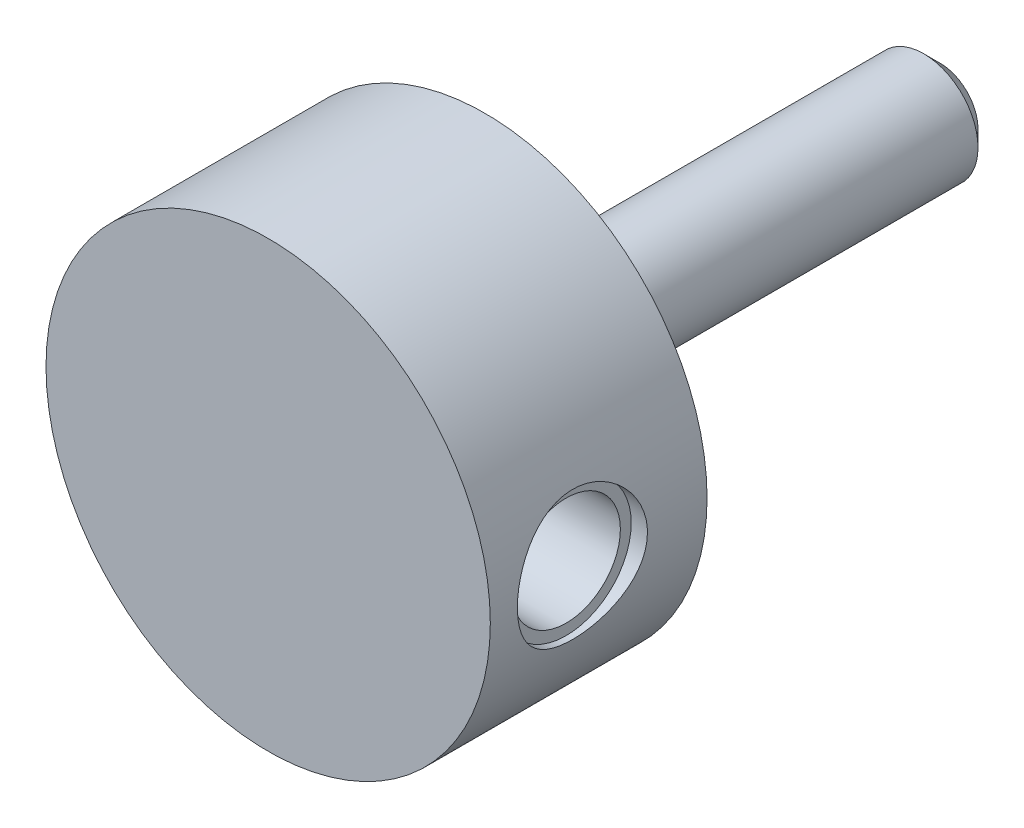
ISO-10303-21;
HEADER;
FILE_DESCRIPTION(('STEP AP214'),'2;1');
FILE_NAME('part.step','',(''),(''),'','','');
FILE_SCHEMA(('AUTOMOTIVE_DESIGN { 1 0 10303 214 1 1 1 1 }'));
ENDSEC;
DATA;
#1=APPLICATION_CONTEXT('core data for automotive mechanical design processes');
#2=APPLICATION_PROTOCOL_DEFINITION('international standard','automotive_design',2000,#1);
#3=PRODUCT_CONTEXT('',#1,'mechanical');
#4=PRODUCT('Part','Part','',(#3));
#5=PRODUCT_RELATED_PRODUCT_CATEGORY('part','',(#4));
#6=PRODUCT_DEFINITION_FORMATION('','',#4);
#7=PRODUCT_DEFINITION_CONTEXT('part definition',#1,'design');
#8=PRODUCT_DEFINITION('design','',#6,#7);
#9=PRODUCT_DEFINITION_SHAPE('','',#8);
#10=(LENGTH_UNIT() NAMED_UNIT(*) SI_UNIT(.MILLI.,.METRE.));
#11=(NAMED_UNIT(*) PLANE_ANGLE_UNIT() SI_UNIT($,.RADIAN.));
#12=(NAMED_UNIT(*) SI_UNIT($,.STERADIAN.) SOLID_ANGLE_UNIT());
#13=UNCERTAINTY_MEASURE_WITH_UNIT(LENGTH_MEASURE(1.E-05),#10,'distance_accuracy_value','');
#14=(GEOMETRIC_REPRESENTATION_CONTEXT(3) GLOBAL_UNCERTAINTY_ASSIGNED_CONTEXT((#13)) GLOBAL_UNIT_ASSIGNED_CONTEXT((#10,
#11,#12)) REPRESENTATION_CONTEXT('',''));
#15=CARTESIAN_POINT('',(0.,0.,0.));
#16=DIRECTION('',(0.,0.,1.));
#17=DIRECTION('',(1.,0.,0.));
#18=AXIS2_PLACEMENT_3D('',#15,#16,#17);
#19=CARTESIAN_POINT('',(0.,0.,0.));
#20=DIRECTION('',(0.,0.,1.));
#21=DIRECTION('',(1.,0.,0.));
#22=AXIS2_PLACEMENT_3D('',#19,#20,#21);
#23=PLANE('',#22);
#24=CARTESIAN_POINT('',(0.,0.,0.));
#25=DIRECTION('',(0.,0.,1.));
#26=DIRECTION('',(1.,0.,0.));
#27=AXIS2_PLACEMENT_3D('',#24,#25,#26);
#28=CIRCLE('',#27,9.5);
#29=CARTESIAN_POINT('',(9.5,0.,0.));
#30=VERTEX_POINT('',#29);
#31=EDGE_CURVE('E27',#30,#30,#28,.T.);
#32=ORIENTED_EDGE('',*,*,#31,.F.);
#33=EDGE_LOOP('',(#32));
#34=FACE_BOUND('',#33,.T.);
#35=CARTESIAN_POINT('',(0.,0.,0.));
#36=DIRECTION('',(0.,0.,1.));
#37=DIRECTION('',(1.,0.,0.));
#38=AXIS2_PLACEMENT_3D('',#35,#36,#37);
#39=CIRCLE('',#38,5.);
#40=CARTESIAN_POINT('',(5.,0.,0.));
#41=VERTEX_POINT('',#40);
#42=EDGE_CURVE('E23',#41,#41,#39,.F.);
#43=ORIENTED_EDGE('',*,*,#42,.F.);
#44=EDGE_LOOP('',(#43));
#45=FACE_BOUND('',#44,.T.);
#46=ADVANCED_FACE('F12',(#34,#45),#23,.F.);
#47=CARTESIAN_POINT('',(0.,0.,40.));
#48=DIRECTION('',(0.,0.,1.));
#49=DIRECTION('',(1.,0.,0.));
#50=AXIS2_PLACEMENT_3D('',#47,#48,#49);
#51=CYLINDRICAL_SURFACE('',#50,9.5);
#52=CARTESIAN_POINT('',(0.,0.,2.));
#53=DIRECTION('',(0.,0.,1.));
#54=DIRECTION('',(1.,0.,0.));
#55=AXIS2_PLACEMENT_3D('',#52,#53,#54);
#56=CIRCLE('',#55,9.5);
#57=CARTESIAN_POINT('',(9.5,0.,2.));
#58=VERTEX_POINT('',#57);
#59=EDGE_CURVE('E38',#58,#58,#56,.T.);
#60=ORIENTED_EDGE('',*,*,#59,.F.);
#61=EDGE_LOOP('',(#60));
#62=FACE_BOUND('',#61,.T.);
#63=ORIENTED_EDGE('',*,*,#31,.T.);
#64=EDGE_LOOP('',(#63));
#65=FACE_BOUND('',#64,.T.);
#66=ADVANCED_FACE('F65',(#62,#65),#51,.T.);
#67=CARTESIAN_POINT('',(20.5,0.,22.));
#68=DIRECTION('',(0.,0.,-1.));
#69=DIRECTION('',(-1.,0.,0.));
#70=AXIS2_PLACEMENT_3D('',#67,#68,#69);
#71=PLANE('',#70);
#72=CARTESIAN_POINT('',(0.,0.,22.));
#73=DIRECTION('',(0.,0.,1.));
#74=DIRECTION('',(1.,0.,0.));
#75=AXIS2_PLACEMENT_3D('',#72,#73,#74);
#76=CIRCLE('',#75,20.5);
#77=CARTESIAN_POINT('',(20.5,0.,22.));
#78=VERTEX_POINT('',#77);
#79=EDGE_CURVE('E82',#78,#78,#76,.T.);
#80=ORIENTED_EDGE('',*,*,#79,.T.);
#81=EDGE_LOOP('',(#80));
#82=FACE_BOUND('',#81,.T.);
#83=ADVANCED_FACE('F60',(#82),#71,.F.);
#84=CARTESIAN_POINT('',(0.,0.,40.));
#85=DIRECTION('',(0.,0.,1.));
#86=DIRECTION('',(1.,0.,0.));
#87=AXIS2_PLACEMENT_3D('',#84,#85,#86);
#88=CYLINDRICAL_SURFACE('',#87,20.5);
#89=CARTESIAN_POINT('',(20.5,0.,7.5));
#90=CARTESIAN_POINT('',(20.4999997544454,-0.164768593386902,7.50000038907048));
#91=CARTESIAN_POINT('',(20.4980087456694,-0.329544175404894,7.50679278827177));
#92=CARTESIAN_POINT('',(20.4900990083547,-0.65788822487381,7.5339021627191));
#93=CARTESIAN_POINT('',(20.4841800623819,-0.821456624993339,7.55421988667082));
#94=CARTESIAN_POINT('',(20.4685766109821,-1.1462122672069,7.60820100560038));
#95=CARTESIAN_POINT('',(20.4588916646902,-1.30739922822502,7.64186596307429));
#96=CARTESIAN_POINT('',(20.4360164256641,-1.62628314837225,7.72226244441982));
#97=CARTESIAN_POINT('',(20.4228249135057,-1.7839788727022,7.76899851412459));
#98=CARTESIAN_POINT('',(20.3933182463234,-2.09448185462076,7.87505403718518));
#99=CARTESIAN_POINT('',(20.3770082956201,-2.24729676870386,7.93435254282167));
#100=CARTESIAN_POINT('',(20.3416823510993,-2.54730770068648,8.06511256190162));
#101=CARTESIAN_POINT('',(20.3226662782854,-2.69450355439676,8.13657443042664));
#102=CARTESIAN_POINT('',(20.2824208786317,-2.98237032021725,8.2911456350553));
#103=CARTESIAN_POINT('',(20.2611910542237,-3.123039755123,8.37425759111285));
#104=CARTESIAN_POINT('',(20.2170775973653,-3.39691169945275,8.55150630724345));
#105=CARTESIAN_POINT('',(20.1941944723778,-3.53011647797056,8.6456396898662));
#106=CARTESIAN_POINT('',(20.146767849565,-3.79154794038,8.84682399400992));
#107=CARTESIAN_POINT('',(20.1221971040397,-3.91956600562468,8.95413966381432));
#108=CARTESIAN_POINT('',(20.0725990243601,-4.1661228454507,9.17897611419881));
#109=CARTESIAN_POINT('',(20.0475718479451,-4.2846648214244,9.29649342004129));
#110=CARTESIAN_POINT('',(19.9977175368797,-4.5116297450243,9.54108035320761));
#111=CARTESIAN_POINT('',(19.9728905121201,-4.62004743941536,9.66815487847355));
#112=CARTESIAN_POINT('',(19.9241410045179,-4.82595045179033,9.93095842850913));
#113=CARTESIAN_POINT('',(19.9002181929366,-4.92343976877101,10.0666842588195));
#114=CARTESIAN_POINT('',(19.8534354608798,-5.10885934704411,10.3490171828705));
#115=CARTESIAN_POINT('',(19.8306098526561,-5.19653638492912,10.4957964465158));
#116=CARTESIAN_POINT('',(19.7872868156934,-5.35913808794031,10.7965125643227));
#117=CARTESIAN_POINT('',(19.766788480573,-5.43406772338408,10.9504465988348));
#118=CARTESIAN_POINT('',(19.7287391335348,-5.57062666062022,11.2645036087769));
#119=CARTESIAN_POINT('',(19.7111887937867,-5.63225293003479,11.4246279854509));
#120=CARTESIAN_POINT('',(19.6796082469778,-5.74162541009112,11.7498143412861));
#121=CARTESIAN_POINT('',(19.6655765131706,-5.78937764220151,11.9148741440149));
#122=CARTESIAN_POINT('',(19.6418018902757,-5.86952471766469,12.2443484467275));
#123=CARTESIAN_POINT('',(19.6319555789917,-5.90229162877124,12.4086649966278));
#124=CARTESIAN_POINT('',(19.6163432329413,-5.95397424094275,12.7395899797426));
#125=CARTESIAN_POINT('',(19.6105755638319,-5.97289549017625,12.9061974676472));
#126=CARTESIAN_POINT('',(19.603301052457,-5.99672775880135,13.2405034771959));
#127=CARTESIAN_POINT('',(19.6017941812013,-6.00163887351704,13.4082019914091));
#128=CARTESIAN_POINT('',(19.6030905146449,-5.99740342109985,13.7434027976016));
#129=CARTESIAN_POINT('',(19.6058936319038,-5.98825713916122,13.9109050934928));
#130=CARTESIAN_POINT('',(19.6155486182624,-5.95655212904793,14.238688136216));
#131=CARTESIAN_POINT('',(19.6222578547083,-5.9344657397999,14.3990190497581));
#132=CARTESIAN_POINT('',(19.6394095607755,-5.87745500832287,14.7172343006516));
#133=CARTESIAN_POINT('',(19.649853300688,-5.84252629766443,14.8751177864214));
#134=CARTESIAN_POINT('',(19.6741615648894,-5.7601395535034,15.187257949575));
#135=CARTESIAN_POINT('',(19.688025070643,-5.71268525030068,15.3415156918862));
#136=CARTESIAN_POINT('',(19.7187796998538,-5.60560692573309,15.6454959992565));
#137=CARTESIAN_POINT('',(19.7356719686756,-5.5459782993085,15.7952168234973));
#138=CARTESIAN_POINT('',(19.7722410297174,-5.41416819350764,16.0910079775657));
#139=CARTESIAN_POINT('',(19.7919506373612,-5.34183608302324,16.2370072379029));
#140=CARTESIAN_POINT('',(19.8334359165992,-5.18568691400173,16.5224423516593));
#141=CARTESIAN_POINT('',(19.8552123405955,-5.10186566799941,16.6618757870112));
#142=CARTESIAN_POINT('',(19.9227548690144,-4.8340177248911,17.0689782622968));
#143=CARTESIAN_POINT('',(19.9707648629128,-4.63350124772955,17.3256854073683));
#144=CARTESIAN_POINT('',(20.0696162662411,-4.18511260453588,17.8126329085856));
#145=CARTESIAN_POINT('',(20.1204944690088,-3.93567819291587,18.0414205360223));
#146=CARTESIAN_POINT('',(20.2176813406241,-3.40132203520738,18.4542852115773));
#147=CARTESIAN_POINT('',(20.2639897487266,-3.11639826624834,18.63835970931));
#148=CARTESIAN_POINT('',(20.3472018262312,-2.51664006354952,18.9573414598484));
#149=CARTESIAN_POINT('',(20.3840462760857,-2.2016334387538,19.0919412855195));
#150=CARTESIAN_POINT('',(20.4437541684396,-1.55212614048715,19.3058343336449));
#151=CARTESIAN_POINT('',(20.4666213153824,-1.21763065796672,19.3851422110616));
#152=CARTESIAN_POINT('',(20.4952175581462,-0.550953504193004,19.4838192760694));
#153=CARTESIAN_POINT('',(20.5015074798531,-0.219085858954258,19.5051506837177));
#154=CARTESIAN_POINT('',(20.4978783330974,0.44350281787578,19.4927506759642));
#155=CARTESIAN_POINT('',(20.4879613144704,0.774223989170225,19.4590262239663));
#156=CARTESIAN_POINT('',(20.4533992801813,1.41781519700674,19.3390673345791));
#157=CARTESIAN_POINT('',(20.4290727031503,1.73091547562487,19.253967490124));
#158=CARTESIAN_POINT('',(20.3684901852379,2.33834273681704,19.0350155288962));
#159=CARTESIAN_POINT('',(20.3322328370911,2.63266749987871,18.901157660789));
#160=CARTESIAN_POINT('',(20.2505580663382,3.201467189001,18.585163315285));
#161=CARTESIAN_POINT('',(20.2049537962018,3.47535043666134,18.4020133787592));
#162=CARTESIAN_POINT('',(20.1098009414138,3.98926947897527,17.9937010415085));
#163=CARTESIAN_POINT('',(20.0602514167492,4.22929716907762,17.7685286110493));
#164=CARTESIAN_POINT('',(19.9860369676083,4.56311282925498,17.3996018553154));
#165=CARTESIAN_POINT('',(19.9608943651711,4.67160496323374,17.2689475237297));
#166=CARTESIAN_POINT('',(19.9116554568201,4.87720494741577,16.9988051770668));
#167=CARTESIAN_POINT('',(19.8875587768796,4.97431688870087,16.8593203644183));
#168=CARTESIAN_POINT('',(19.8411019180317,5.15650338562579,16.5723575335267));
#169=CARTESIAN_POINT('',(19.8187424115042,5.24157329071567,16.4248764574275));
#170=CARTESIAN_POINT('',(19.7764458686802,5.39896546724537,16.1230001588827));
#171=CARTESIAN_POINT('',(19.7565078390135,5.47129297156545,15.9686078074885));
#172=CARTESIAN_POINT('',(19.7197444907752,5.60234699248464,15.6546484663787));
#173=CARTESIAN_POINT('',(19.7029051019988,5.6611353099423,15.49510893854));
#174=CARTESIAN_POINT('',(19.6727610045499,5.76501533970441,15.1713718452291));
#175=CARTESIAN_POINT('',(19.6594548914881,5.81011249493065,15.0071761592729));
#176=CARTESIAN_POINT('',(19.6367999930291,5.88622676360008,14.675294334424));
#177=CARTESIAN_POINT('',(19.6274509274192,5.91724487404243,14.5076084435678));
#178=CARTESIAN_POINT('',(19.6130187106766,5.96490739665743,14.1700260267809));
#179=CARTESIAN_POINT('',(19.6079354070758,5.98155232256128,14.0001295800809));
#180=CARTESIAN_POINT('',(19.6023186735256,5.9999323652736,13.6662567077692));
#181=CARTESIAN_POINT('',(19.6016119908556,6.00223524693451,13.5023141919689));
#182=CARTESIAN_POINT('',(19.6043094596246,5.99341910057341,13.1747666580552));
#183=CARTESIAN_POINT('',(19.6077150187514,5.98229547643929,13.0111617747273));
#184=CARTESIAN_POINT('',(19.6185313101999,5.94672790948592,12.6856110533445));
#185=CARTESIAN_POINT('',(19.6259403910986,5.92228945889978,12.5236645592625));
#186=CARTESIAN_POINT('',(19.6445384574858,5.86030325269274,12.2024601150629));
#187=CARTESIAN_POINT('',(19.6557288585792,5.82275058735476,12.0432031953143));
#188=CARTESIAN_POINT('',(19.6814005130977,5.73537439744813,11.7303823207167));
#189=CARTESIAN_POINT('',(19.6958418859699,5.68569901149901,11.5767736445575));
#190=CARTESIAN_POINT('',(19.7276768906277,5.57423736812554,11.2742707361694));
#191=CARTESIAN_POINT('',(19.7450715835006,5.51244675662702,11.125378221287));
#192=CARTESIAN_POINT('',(19.782319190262,5.37724463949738,10.8333301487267));
#193=CARTESIAN_POINT('',(19.802171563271,5.30383568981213,10.6901733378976));
#194=CARTESIAN_POINT('',(19.8438063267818,5.14587421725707,10.4103722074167));
#195=CARTESIAN_POINT('',(19.8655894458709,5.061317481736,10.2737303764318));
#196=CARTESIAN_POINT('',(19.9112797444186,4.87853600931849,10.0032239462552));
#197=CARTESIAN_POINT('',(19.9352342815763,4.77994030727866,9.86961789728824));
#198=CARTESIAN_POINT('',(19.9839347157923,4.57206196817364,9.61107007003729));
#199=CARTESIAN_POINT('',(20.0086809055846,4.46277534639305,9.48613155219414));
#200=CARTESIAN_POINT('',(20.0582834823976,4.23425660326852,9.24575891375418));
#201=CARTESIAN_POINT('',(20.0831398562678,4.11502564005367,9.13032368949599));
#202=CARTESIAN_POINT('',(20.1323098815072,3.86730499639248,8.90963180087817));
#203=CARTESIAN_POINT('',(20.1566233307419,3.7388119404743,8.80437888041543));
#204=CARTESIAN_POINT('',(20.2046974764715,3.46977987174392,8.6020699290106));
#205=CARTESIAN_POINT('',(20.2284250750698,3.32900807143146,8.50531528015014));
#206=CARTESIAN_POINT('',(20.2739466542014,3.03949915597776,8.32403500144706));
#207=CARTESIAN_POINT('',(20.2957406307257,2.8907620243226,8.23950939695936));
#208=CARTESIAN_POINT('',(20.3367679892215,2.58639447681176,8.0833769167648));
#209=CARTESIAN_POINT('',(20.356002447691,2.43076699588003,8.01176460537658));
#210=CARTESIAN_POINT('',(20.3913677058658,2.11366097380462,7.88201306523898));
#211=CARTESIAN_POINT('',(20.4074988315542,1.95218304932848,7.82387242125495));
#212=CARTESIAN_POINT('',(20.4344672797,1.64423058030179,7.72771145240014));
#213=CARTESIAN_POINT('',(20.4457076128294,1.49828162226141,7.68811373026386));
#214=CARTESIAN_POINT('',(20.4651675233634,1.2036242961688,7.62002138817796));
#215=CARTESIAN_POINT('',(20.4733873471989,1.0549161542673,7.59152586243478));
#216=CARTESIAN_POINT('',(20.4866168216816,0.755624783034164,7.54584620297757));
#217=CARTESIAN_POINT('',(20.491626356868,0.605041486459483,7.52866247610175));
#218=CARTESIAN_POINT('',(20.49831762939,0.302973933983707,7.50574067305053));
#219=CARTESIAN_POINT('',(20.5000002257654,0.151489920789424,7.49999964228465));
#220=CARTESIAN_POINT('',(20.5,0.,7.5));
#221=B_SPLINE_CURVE_WITH_KNOTS('',3,(#89,#90,#91,#92,#93,#94,#95,#96,#97,#98,#99,#100,#101,#102,
#103,#104,#105,#106,#107,#108,#109,#110,#111,#112,#113,#114,#115,#116,#117,#118,#119,#120,#121,
#122,#123,#124,#125,#126,#127,#128,#129,#130,#131,#132,#133,#134,#135,#136,#137,#138,#139,#140,
#141,#142,#143,#144,#145,#146,#147,#148,#149,#150,#151,#152,#153,#154,#155,#156,#157,#158,#159,
#160,#161,#162,#163,#164,#165,#166,#167,#168,#169,#170,#171,#172,#173,#174,#175,#176,#177,#178,
#179,#180,#181,#182,#183,#184,#185,#186,#187,#188,#189,#190,#191,#192,#193,#194,#195,#196,#197,
#198,#199,#200,#201,#202,#203,#204,#205,#206,#207,#208,#209,#210,#211,#212,#213,#214,#215,#216,
#217,#218,#219,#220),.UNSPECIFIED.,.T.,.F.,(4,2,2,2,2,2,2,2,2,2,2,2,2,2,2,2,2,2,2,2,2,2,2,2,2,2,
2,2,2,2,2,2,2,2,2,2,2,2,2,2,2,2,2,2,2,2,2,2,2,2,2,2,2,2,2,2,2,2,2,2,2,2,2,2,2,4),(0.,
0.494166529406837,0.988360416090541,1.48261217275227,1.97703603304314,2.47064184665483,
2.96426207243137,3.45799348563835,3.95157399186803,4.45753270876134,4.96331976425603,
5.46936781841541,5.97523008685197,6.49206535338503,7.00869863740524,7.52544955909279,
8.04197586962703,8.54486934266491,9.04756118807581,9.55024961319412,10.0529278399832,
10.5383093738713,11.0238561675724,11.5092585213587,11.9948448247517,12.4866344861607,
12.9786038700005,13.9617709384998,14.9839152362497,16.006117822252,17.0345689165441,
18.062747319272,19.0556662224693,20.0484595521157,21.0200911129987,21.9918373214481,
22.9853318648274,23.97906383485,24.4935931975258,25.0079370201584,25.5224789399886,
26.0368090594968,26.5487427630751,27.0604726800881,27.5721663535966,28.0838417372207,
28.5751252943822,29.066577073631,29.5578262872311,30.0492596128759,30.5349645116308,
31.0208442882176,31.5066173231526,31.9925744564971,32.4953010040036,32.9982156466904,
33.5010718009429,34.0041121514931,34.5208552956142,35.0375995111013,35.5541256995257,
36.0705976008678,36.525077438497,36.9795201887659,37.4339792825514,37.8883210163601),.UNSPECIFIED.);
#222=CARTESIAN_POINT('',(20.5,0.,7.5));
#223=VERTEX_POINT('',#222);
#224=EDGE_CURVE('E30',#223,#223,#221,.T.);
#225=ORIENTED_EDGE('',*,*,#224,.T.);
#226=EDGE_LOOP('',(#225));
#227=FACE_BOUND('',#226,.T.);
#228=ORIENTED_EDGE('',*,*,#79,.F.);
#229=EDGE_LOOP('',(#228));
#230=FACE_BOUND('',#229,.T.);
#231=CARTESIAN_POINT('',(0.,0.,2.));
#232=DIRECTION('',(0.,0.,1.));
#233=DIRECTION('',(1.,0.,0.));
#234=AXIS2_PLACEMENT_3D('',#231,#232,#233);
#235=CIRCLE('',#234,20.5);
#236=CARTESIAN_POINT('',(20.5,0.,2.));
#237=VERTEX_POINT('',#236);
#238=EDGE_CURVE('E84',#237,#237,#235,.T.);
#239=ORIENTED_EDGE('',*,*,#238,.T.);
#240=EDGE_LOOP('',(#239));
#241=FACE_BOUND('',#240,.T.);
#242=ADVANCED_FACE('F41',(#227,#230,#241),#88,.T.);
#243=CARTESIAN_POINT('',(9.5,0.,2.));
#244=DIRECTION('',(0.,0.,1.));
#245=DIRECTION('',(1.,0.,0.));
#246=AXIS2_PLACEMENT_3D('',#243,#244,#245);
#247=PLANE('',#246);
#248=ORIENTED_EDGE('',*,*,#238,.F.);
#249=EDGE_LOOP('',(#248));
#250=FACE_BOUND('',#249,.T.);
#251=ORIENTED_EDGE('',*,*,#59,.T.);
#252=EDGE_LOOP('',(#251));
#253=FACE_BOUND('',#252,.T.);
#254=ADVANCED_FACE('F49',(#250,#253),#247,.F.);
#255=CARTESIAN_POINT('',(19.,0.,13.5));
#256=DIRECTION('',(1.,0.,0.));
#257=DIRECTION('',(0.,0.,-1.));
#258=AXIS2_PLACEMENT_3D('',#255,#256,#257);
#259=CYLINDRICAL_SURFACE('',#258,6.);
#260=CARTESIAN_POINT('',(19.,0.,13.5));
#261=DIRECTION('',(1.,0.,0.));
#262=DIRECTION('',(0.,0.,-1.));
#263=AXIS2_PLACEMENT_3D('',#260,#261,#262);
#264=CIRCLE('',#263,6.);
#265=CARTESIAN_POINT('',(19.,0.,7.5));
#266=VERTEX_POINT('',#265);
#267=EDGE_CURVE('E39',#266,#266,#264,.T.);
#268=ORIENTED_EDGE('',*,*,#267,.F.);
#269=EDGE_LOOP('',(#268));
#270=FACE_BOUND('',#269,.T.);
#271=ORIENTED_EDGE('',*,*,#224,.F.);
#272=EDGE_LOOP('',(#271));
#273=FACE_BOUND('',#272,.T.);
#274=ADVANCED_FACE('F47',(#270,#273),#259,.F.);
#275=CARTESIAN_POINT('',(19.,0.,13.5));
#276=DIRECTION('',(1.,0.,0.));
#277=DIRECTION('',(0.,0.,-1.));
#278=AXIS2_PLACEMENT_3D('',#275,#276,#277);
#279=PLANE('',#278);
#280=CARTESIAN_POINT('',(19.,0.,13.5));
#281=DIRECTION('',(1.,0.,0.));
#282=DIRECTION('',(0.,0.,-1.));
#283=AXIS2_PLACEMENT_3D('',#280,#281,#282);
#284=CIRCLE('',#283,5.);
#285=CARTESIAN_POINT('',(19.,0.,8.5));
#286=VERTEX_POINT('',#285);
#287=EDGE_CURVE('E96',#286,#286,#284,.T.);
#288=ORIENTED_EDGE('',*,*,#287,.F.);
#289=EDGE_LOOP('',(#288));
#290=FACE_BOUND('',#289,.T.);
#291=ORIENTED_EDGE('',*,*,#267,.T.);
#292=EDGE_LOOP('',(#291));
#293=FACE_BOUND('',#292,.T.);
#294=ADVANCED_FACE('F58',(#290,#293),#279,.T.);
#295=CARTESIAN_POINT('',(10.,0.,13.5));
#296=DIRECTION('',(1.,0.,0.));
#297=DIRECTION('',(0.,0.,-1.));
#298=AXIS2_PLACEMENT_3D('',#295,#296,#297);
#299=CYLINDRICAL_SURFACE('',#298,5.);
#300=CARTESIAN_POINT('',(10.,0.,13.5));
#301=DIRECTION('',(1.,0.,0.));
#302=DIRECTION('',(0.,0.,-1.));
#303=AXIS2_PLACEMENT_3D('',#300,#301,#302);
#304=CIRCLE('',#303,5.);
#305=CARTESIAN_POINT('',(10.,0.,8.5));
#306=VERTEX_POINT('',#305);
#307=EDGE_CURVE('E93',#306,#306,#304,.T.);
#308=ORIENTED_EDGE('',*,*,#307,.F.);
#309=EDGE_LOOP('',(#308));
#310=FACE_BOUND('',#309,.T.);
#311=ORIENTED_EDGE('',*,*,#287,.T.);
#312=EDGE_LOOP('',(#311));
#313=FACE_BOUND('',#312,.T.);
#314=ADVANCED_FACE('F100',(#310,#313),#299,.F.);
#315=CARTESIAN_POINT('',(10.,0.,13.5));
#316=DIRECTION('',(1.,0.,0.));
#317=DIRECTION('',(0.,0.,-1.));
#318=AXIS2_PLACEMENT_3D('',#315,#316,#317);
#319=PLANE('',#318);
#320=ORIENTED_EDGE('',*,*,#307,.T.);
#321=EDGE_LOOP('',(#320));
#322=FACE_BOUND('',#321,.T.);
#323=ADVANCED_FACE('F112',(#322),#319,.T.);
#324=CARTESIAN_POINT('',(0.,0.,-40.));
#325=DIRECTION('',(0.,0.,1.));
#326=DIRECTION('',(1.,0.,0.));
#327=AXIS2_PLACEMENT_3D('',#324,#325,#326);
#328=CYLINDRICAL_SURFACE('',#327,5.);
#329=CARTESIAN_POINT('',(0.,0.,-38.5));
#330=DIRECTION('',(0.,0.,-1.));
#331=DIRECTION('',(-1.,0.,0.));
#332=AXIS2_PLACEMENT_3D('',#329,#330,#331);
#333=CIRCLE('',#332,5.);
#334=CARTESIAN_POINT('',(-5.,0.,-38.5));
#335=VERTEX_POINT('',#334);
#336=EDGE_CURVE('E8',#335,#335,#333,.F.);
#337=ORIENTED_EDGE('',*,*,#336,.T.);
#338=EDGE_LOOP('',(#337));
#339=FACE_BOUND('',#338,.T.);
#340=ORIENTED_EDGE('',*,*,#42,.T.);
#341=EDGE_LOOP('',(#340));
#342=FACE_BOUND('',#341,.T.);
#343=ADVANCED_FACE('F118',(#339,#342),#328,.T.);
#344=CARTESIAN_POINT('',(0.,0.,-40.));
#345=DIRECTION('',(0.,0.,-1.));
#346=DIRECTION('',(-1.,0.,0.));
#347=AXIS2_PLACEMENT_3D('',#344,#345,#346);
#348=PLANE('',#347);
#349=CARTESIAN_POINT('',(0.,0.,-40.));
#350=DIRECTION('',(0.,0.,-1.));
#351=DIRECTION('',(-1.,0.,0.));
#352=AXIS2_PLACEMENT_3D('',#349,#350,#351);
#353=CIRCLE('',#352,3.5);
#354=CARTESIAN_POINT('',(-3.5,0.,-40.));
#355=VERTEX_POINT('',#354);
#356=EDGE_CURVE('E19',#355,#355,#353,.T.);
#357=ORIENTED_EDGE('',*,*,#356,.T.);
#358=EDGE_LOOP('',(#357));
#359=FACE_BOUND('',#358,.T.);
#360=ADVANCED_FACE('F122',(#359),#348,.T.);
#361=CARTESIAN_POINT('',(0.,0.,-40.));
#362=DIRECTION('',(0.,0.,1.));
#363=DIRECTION('',(1.,0.,0.));
#364=AXIS2_PLACEMENT_3D('',#361,#362,#363);
#365=CONICAL_SURFACE('',#364,3.5,0.785398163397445);
#366=ORIENTED_EDGE('',*,*,#336,.F.);
#367=EDGE_LOOP('',(#366));
#368=FACE_BOUND('',#367,.T.);
#369=ORIENTED_EDGE('',*,*,#356,.F.);
#370=EDGE_LOOP('',(#369));
#371=FACE_BOUND('',#370,.T.);
#372=ADVANCED_FACE('F14',(#368,#371),#365,.T.);
#373=CLOSED_SHELL('',(#46,#66,#83,#242,#254,#274,#294,#314,#323,#343,#360,#372));
#374=MANIFOLD_SOLID_BREP('B1',#373);
#375=ADVANCED_BREP_SHAPE_REPRESENTATION('',(#18,#374),#14);
#376=SHAPE_DEFINITION_REPRESENTATION(#9,#375);
ENDSEC;
END-ISO-10303-21;
